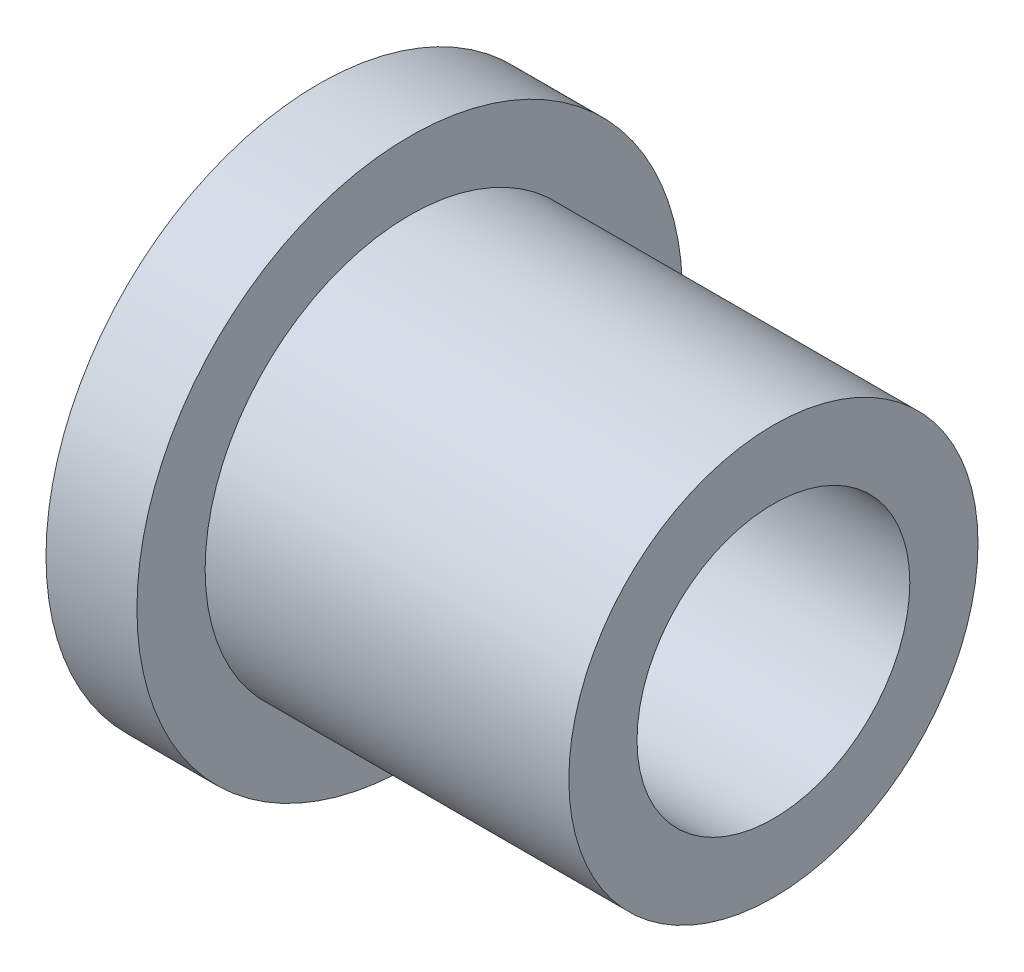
from build123d import *


with BuildPart() as part:
    # Sketch1 → Revolve1 (revolve)
    with BuildSketch(Plane.XY, mode=Mode.PRIVATE) as revolve1_sk:
        Polygon((0, 4.7625), (0, 9.525), (3.175, 9.525), (3.175, 7.14375), (15.875, 7.14375), (15.875, 4.7625), align=None)
    revolve(revolve1_sk.sketch.rotate(Axis((0, 0, 0), (1, 0, 0)), 90), axis=Axis((0, 0, 0), (1, 0, 0)))


solid = part.part
